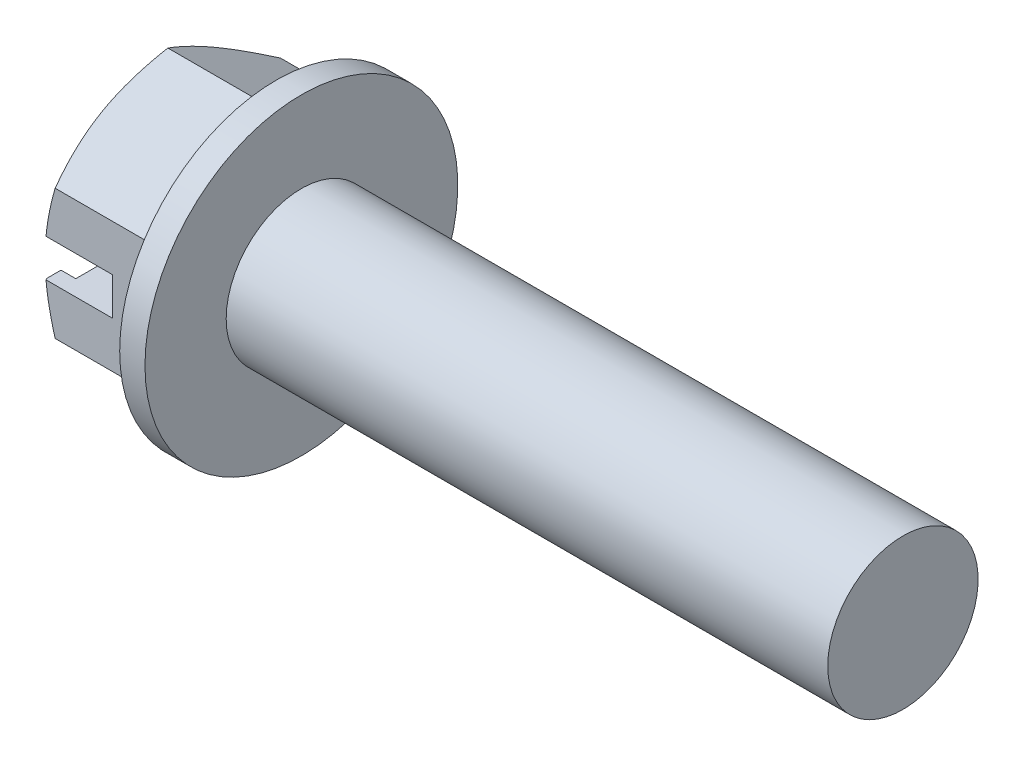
from build123d import *

# Parameters (mm, degrees)
HEX_DIE_START = -2e-06
SKETCH2_R     = 10.00506
HEX_DIE_DEPTH = 7.493002
SKETCH3_W     = 16.483602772
SKETCH3_H     = 2.3876
SLOT_DEPTH    = 4.2672
SKETCH4_R     = 6.245225
INDENT_DEPTH  = 0.936625


with BuildPart() as part:
    # BodySke → Base-Revolve (revolve)
    with BuildSketch(Plane.XY, mode=Mode.PRIVATE) as base_revolve_sk:
        Polygon((9.0932, 4.7625), (9.0932, 9.906), (7.493, 9.906), (7.493, 8.241801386), (0.637626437, 8.241801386), (0, 7.1374), (0, 0), (47.1932, 0), (47.1932, 4.7625), align=None)
    revolve(base_revolve_sk.sketch.rotate(Axis((-25.4, 0, 0), (1, 0, 0)), 90), axis=Axis((-25.4, 0, 0), (1, 0, 0)))

    # Sketch2 → Hex-Die (cut)
    with BuildSketch(Plane(origin=(0, 0, 0), x_dir=(0, 0, -1), z_dir=(1, 0, 0)).offset(HEX_DIE_START)):
        Circle(SKETCH2_R)
        Polygon((-7.1374, 4.120779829), (0, 8.241559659), (7.1374, 4.120779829), (7.1374, -4.120779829), (0, -8.241559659), (-7.1374, -4.120779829), align=None, mode=Mode.SUBTRACT)
    extrude(amount=HEX_DIE_DEPTH, mode=Mode.SUBTRACT)

    # Sketch3 → Slot (cut)
    with BuildSketch(Plane(origin=(0, 0, 0), x_dir=(0, 0, -1), z_dir=(1, 0, 0))):
        Rectangle(SKETCH3_W, SKETCH3_H)
    extrude(amount=SLOT_DEPTH, mode=Mode.SUBTRACT)

    # Sketch4 → Indent (cut)
    with BuildSketch(Plane(origin=(0, 0, 0), x_dir=(0, 0, -1), z_dir=(1, 0, 0))):
        Circle(SKETCH4_R)
    extrude(amount=INDENT_DEPTH, mode=Mode.SUBTRACT)


solid = part.part
